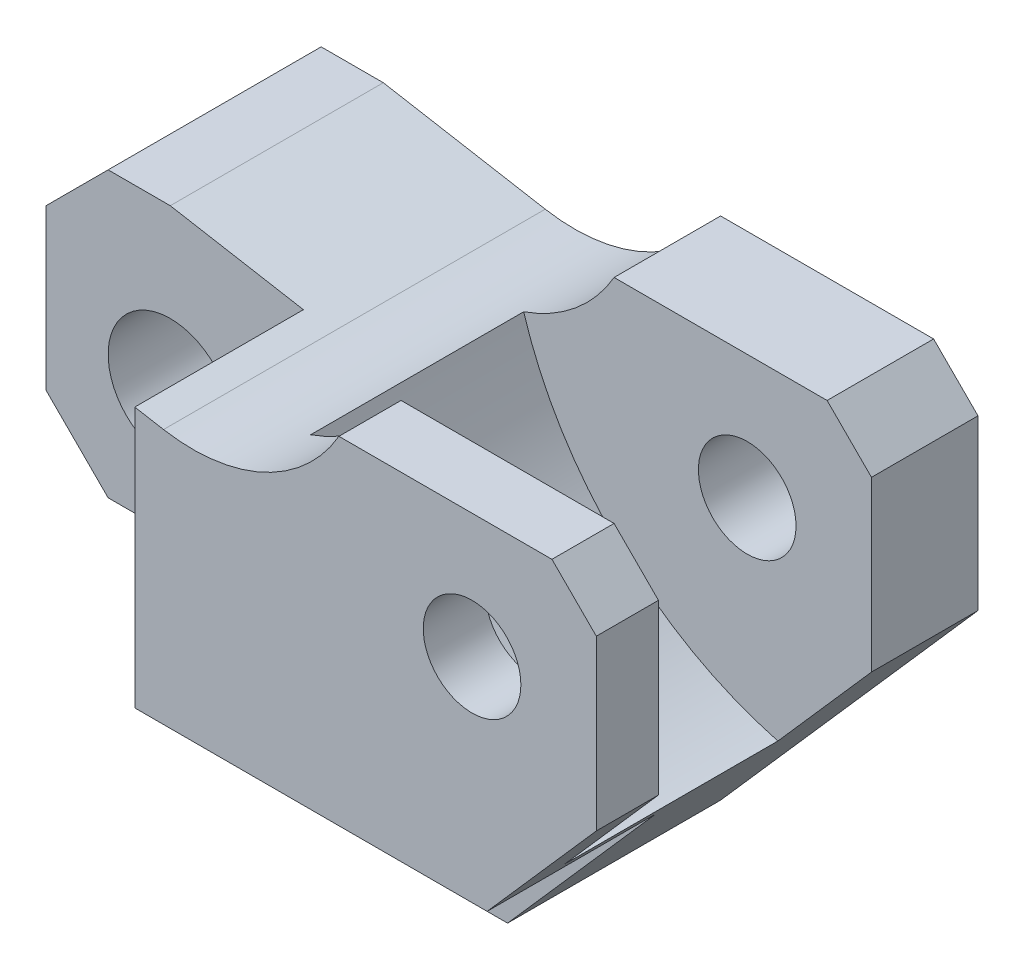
from build123d import *

# Parameters (mm, degrees)
SKETCH_1_R          = 7
EXTRUDE_1_DEPTH     = 43
CUT_EXTRUDE_START   = -19
SKETCH_2_R          = 7
CUT_EXTRUDE_1_DEPTH = 19
SKETCH_2_4_R        = 5.5
CUT_EXTRUDE_2_DEPTH = 87.180044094
CUT_EXTRUDE_START_2 = -7
SKETCH_2_5_R        = 5.5
CUT_EXTRUDE_3_DEPTH = 24


with BuildPart() as part:
    # Sketch 1 → Extrude 1 (new body)
    with BuildSketch(Plane.XY):
        with BuildLine():
            Line((21.066626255, -14), (-7, -14))
            Line((-7, -14), (-14, -7))
            Line((-14, -7), (-14, 11))
            Line((-14, 11), (-7, 18))
            Line((-7, 18), (0, 18))
            Line((0, 18), (18.243084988, 14.783251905))
            ThreePointArc((18.243084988, 14.783251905), (29.574972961, 16.276069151), (38, 24))
            Line((38, 24), (62, 24))
            Line((62, 24), (67, 19))
            Line((67, 19), (67, 0))
            Line((67, 0), (38, -33))
            Line((38, -33), (32.788067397, -33))
            ThreePointArc((32.788067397, -33), (28.3490952, -26.115672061), (26.012264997, -18.264705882))
            ThreePointArc((26.012264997, -18.264705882), (24.331862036, -15.213413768), (21.066626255, -14))
        make_face()
        Circle(SKETCH_1_R, mode=Mode.SUBTRACT)
    extrude(amount=EXTRUDE_1_DEPTH)

    # Sketch 2 → Cut-Extrude 1 (cut)
    # profile 1 of 2: a face of its own
    with BuildSketch(Plane.XY.offset(43).offset(CUT_EXTRUDE_START)):
        with BuildLine():
            Line((54.696969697, -14), (21.066626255, -14))
            ThreePointArc((21.066626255, -14), (24.331862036, -15.213413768), (26.012264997, -18.264705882))
            ThreePointArc((26.012264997, -18.264705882), (28.3490952, -26.115672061), (32.788067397, -33))
            Line((32.788067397, -33), (38, -33))
            Line((38, -33), (54.696969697, -14))
        make_face()
    # profile 2 of 2: a face of its own
    with BuildSketch(Plane.XY.offset(43).offset(CUT_EXTRUDE_START)):
        Polygon((-7, -14), (15, -14), (15, 15.355095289), (0, 18), (-7, 18), (-14, 11), (-14, -7), align=None)
        Circle(SKETCH_2_R, mode=Mode.SUBTRACT)
    extrude(amount=CUT_EXTRUDE_1_DEPTH, mode=Mode.SUBTRACT)

    # Sketch 2_4 → Cut-Extrude 2 (cut, through all)
    with BuildSketch(Plane.XY.offset(43)):
        with Locations((53, 10)):
            Circle(SKETCH_2_4_R)
    extrude(amount=-CUT_EXTRUDE_2_DEPTH, mode=Mode.SUBTRACT)

    # Sketch 2_5 → Cut-Extrude 3 (cut)
    with BuildSketch(Plane.XY.offset(43).offset(CUT_EXTRUDE_START_2)):
        with BuildLine():
            ThreePointArc((38, 24), (33.665353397, 18.864697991), (27.814145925, 15.559571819))
            ThreePointArc((27.814145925, 15.559571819), (38.571435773, -1.922853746), (56.454545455, -12))
            Line((56.454545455, -12), (67, 0))
            Line((67, 0), (67, 19))
            Line((67, 19), (62, 24))
            Line((62, 24), (38, 24))
        make_face()
        with Locations((53, 10)):
            Circle(SKETCH_2_5_R, mode=Mode.SUBTRACT)
    extrude(amount=-CUT_EXTRUDE_3_DEPTH, mode=Mode.SUBTRACT)


solid = part.part
